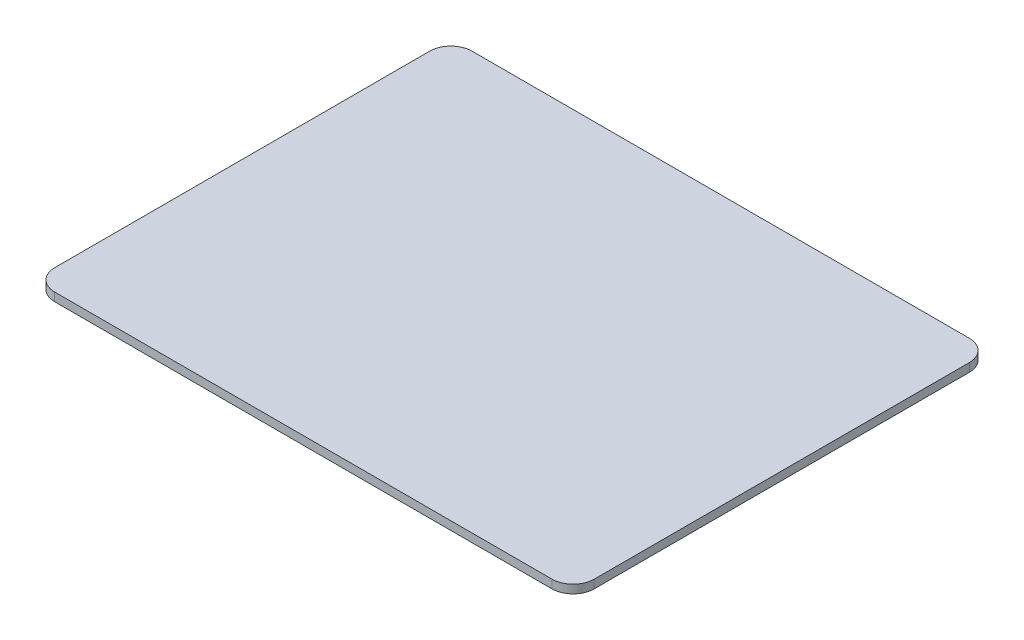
ISO-10303-21;
HEADER;
FILE_DESCRIPTION(('STEP AP214'),'2;1');
FILE_NAME('part.step','',(''),(''),'','','');
FILE_SCHEMA(('AUTOMOTIVE_DESIGN { 1 0 10303 214 1 1 1 1 }'));
ENDSEC;
DATA;
#1=APPLICATION_CONTEXT('core data for automotive mechanical design processes');
#2=APPLICATION_PROTOCOL_DEFINITION('international standard','automotive_design',2000,#1);
#3=PRODUCT_CONTEXT('',#1,'mechanical');
#4=PRODUCT('Part','Part','',(#3));
#5=PRODUCT_RELATED_PRODUCT_CATEGORY('part','',(#4));
#6=PRODUCT_DEFINITION_FORMATION('','',#4);
#7=PRODUCT_DEFINITION_CONTEXT('part definition',#1,'design');
#8=PRODUCT_DEFINITION('design','',#6,#7);
#9=PRODUCT_DEFINITION_SHAPE('','',#8);
#10=(LENGTH_UNIT() NAMED_UNIT(*) SI_UNIT(.MILLI.,.METRE.));
#11=(NAMED_UNIT(*) PLANE_ANGLE_UNIT() SI_UNIT($,.RADIAN.));
#12=(NAMED_UNIT(*) SI_UNIT($,.STERADIAN.) SOLID_ANGLE_UNIT());
#13=UNCERTAINTY_MEASURE_WITH_UNIT(LENGTH_MEASURE(1.E-05),#10,'distance_accuracy_value','');
#14=(GEOMETRIC_REPRESENTATION_CONTEXT(3) GLOBAL_UNCERTAINTY_ASSIGNED_CONTEXT((#13)) GLOBAL_UNIT_ASSIGNED_CONTEXT((#10,
#11,#12)) REPRESENTATION_CONTEXT('',''));
#15=CARTESIAN_POINT('',(0.,0.,0.));
#16=DIRECTION('',(0.,0.,1.));
#17=DIRECTION('',(1.,0.,0.));
#18=AXIS2_PLACEMENT_3D('',#15,#16,#17);
#19=CARTESIAN_POINT('',(0.,1.,0.));
#20=DIRECTION('',(1.,0.,0.));
#21=DIRECTION('',(0.,0.,-1.));
#22=AXIS2_PLACEMENT_3D('',#19,#20,#21);
#23=PLANE('',#22);
#24=DIRECTION('',(0.,0.,1.));
#25=VECTOR('',#24,1.);
#26=CARTESIAN_POINT('',(0.,1.,0.));
#27=LINE('',#26,#25);
#28=CARTESIAN_POINT('',(0.,1.,-47.));
#29=VERTEX_POINT('',#28);
#30=CARTESIAN_POINT('',(0.,1.,-2.5));
#31=VERTEX_POINT('',#30);
#32=EDGE_CURVE('E118',#29,#31,#27,.T.);
#33=ORIENTED_EDGE('',*,*,#32,.F.);
#34=DIRECTION('',(0.,-1.,0.));
#35=VECTOR('',#34,1.);
#36=CARTESIAN_POINT('',(0.,1.,-47.));
#37=LINE('',#36,#35);
#38=CARTESIAN_POINT('',(0.,0.,-47.));
#39=VERTEX_POINT('',#38);
#40=EDGE_CURVE('E103',#29,#39,#37,.T.);
#41=ORIENTED_EDGE('',*,*,#40,.T.);
#42=DIRECTION('',(0.,0.,1.));
#43=VECTOR('',#42,1.);
#44=CARTESIAN_POINT('',(0.,0.,0.));
#45=LINE('',#44,#43);
#46=CARTESIAN_POINT('',(0.,0.,-2.5));
#47=VERTEX_POINT('',#46);
#48=EDGE_CURVE('E115',#39,#47,#45,.T.);
#49=ORIENTED_EDGE('',*,*,#48,.T.);
#50=DIRECTION('',(0.,-1.,0.));
#51=VECTOR('',#50,1.);
#52=CARTESIAN_POINT('',(0.,1.,-2.5));
#53=LINE('',#52,#51);
#54=EDGE_CURVE('E120',#47,#31,#53,.F.);
#55=ORIENTED_EDGE('',*,*,#54,.T.);
#56=EDGE_LOOP('',(#33,#41,#49,#55));
#57=FACE_BOUND('',#56,.T.);
#58=ADVANCED_FACE('F33',(#57),#23,.F.);
#59=CARTESIAN_POINT('',(0.,1.,0.));
#60=DIRECTION('',(0.,0.,-1.));
#61=DIRECTION('',(-1.,0.,0.));
#62=AXIS2_PLACEMENT_3D('',#59,#60,#61);
#63=PLANE('',#62);
#64=DIRECTION('',(1.,0.,0.));
#65=VECTOR('',#64,1.);
#66=CARTESIAN_POINT('',(0.,0.,0.));
#67=LINE('',#66,#65);
#68=CARTESIAN_POINT('',(2.5,0.,0.));
#69=VERTEX_POINT('',#68);
#70=CARTESIAN_POINT('',(61.5,0.,0.));
#71=VERTEX_POINT('',#70);
#72=EDGE_CURVE('E124',#69,#71,#67,.T.);
#73=ORIENTED_EDGE('',*,*,#72,.T.);
#74=DIRECTION('',(0.,-1.,0.));
#75=VECTOR('',#74,1.);
#76=CARTESIAN_POINT('',(61.5,1.,0.));
#77=LINE('',#76,#75);
#78=CARTESIAN_POINT('',(61.5,1.,0.));
#79=VERTEX_POINT('',#78);
#80=EDGE_CURVE('E11',#71,#79,#77,.F.);
#81=ORIENTED_EDGE('',*,*,#80,.T.);
#82=DIRECTION('',(1.,0.,0.));
#83=VECTOR('',#82,1.);
#84=CARTESIAN_POINT('',(0.,1.,0.));
#85=LINE('',#84,#83);
#86=CARTESIAN_POINT('',(2.5,1.,0.));
#87=VERTEX_POINT('',#86);
#88=EDGE_CURVE('E160',#87,#79,#85,.T.);
#89=ORIENTED_EDGE('',*,*,#88,.F.);
#90=DIRECTION('',(0.,-1.,0.));
#91=VECTOR('',#90,1.);
#92=CARTESIAN_POINT('',(2.5,1.,0.));
#93=LINE('',#92,#91);
#94=EDGE_CURVE('E41',#87,#69,#93,.T.);
#95=ORIENTED_EDGE('',*,*,#94,.T.);
#96=EDGE_LOOP('',(#73,#81,#89,#95));
#97=FACE_BOUND('',#96,.T.);
#98=ADVANCED_FACE('F158',(#97),#63,.F.);
#99=CARTESIAN_POINT('',(64.,1.,0.));
#100=DIRECTION('',(-1.,0.,0.));
#101=DIRECTION('',(0.,0.,1.));
#102=AXIS2_PLACEMENT_3D('',#99,#100,#101);
#103=PLANE('',#102);
#104=DIRECTION('',(0.,0.,-1.));
#105=VECTOR('',#104,1.);
#106=CARTESIAN_POINT('',(64.,0.,0.));
#107=LINE('',#106,#105);
#108=CARTESIAN_POINT('',(64.,0.,-2.5));
#109=VERTEX_POINT('',#108);
#110=CARTESIAN_POINT('',(64.,0.,-47.));
#111=VERTEX_POINT('',#110);
#112=EDGE_CURVE('E127',#109,#111,#107,.T.);
#113=ORIENTED_EDGE('',*,*,#112,.T.);
#114=DIRECTION('',(0.,-1.,0.));
#115=VECTOR('',#114,1.);
#116=CARTESIAN_POINT('',(64.,1.,-47.));
#117=LINE('',#116,#115);
#118=CARTESIAN_POINT('',(64.,1.,-47.));
#119=VERTEX_POINT('',#118);
#120=EDGE_CURVE('E48',#111,#119,#117,.F.);
#121=ORIENTED_EDGE('',*,*,#120,.T.);
#122=DIRECTION('',(0.,0.,-1.));
#123=VECTOR('',#122,1.);
#124=CARTESIAN_POINT('',(64.,1.,0.));
#125=LINE('',#124,#123);
#126=CARTESIAN_POINT('',(64.,1.,-2.5));
#127=VERTEX_POINT('',#126);
#128=EDGE_CURVE('E168',#127,#119,#125,.T.);
#129=ORIENTED_EDGE('',*,*,#128,.F.);
#130=DIRECTION('',(0.,-1.,0.));
#131=VECTOR('',#130,1.);
#132=CARTESIAN_POINT('',(64.,1.,-2.5));
#133=LINE('',#132,#131);
#134=EDGE_CURVE('E151',#127,#109,#133,.T.);
#135=ORIENTED_EDGE('',*,*,#134,.T.);
#136=EDGE_LOOP('',(#113,#121,#129,#135));
#137=FACE_BOUND('',#136,.T.);
#138=ADVANCED_FACE('F167',(#137),#103,.F.);
#139=CARTESIAN_POINT('',(0.,1.,-49.5));
#140=DIRECTION('',(0.,0.,1.));
#141=DIRECTION('',(1.,0.,0.));
#142=AXIS2_PLACEMENT_3D('',#139,#140,#141);
#143=PLANE('',#142);
#144=DIRECTION('',(-1.,0.,0.));
#145=VECTOR('',#144,1.);
#146=CARTESIAN_POINT('',(0.,0.,-49.5));
#147=LINE('',#146,#145);
#148=CARTESIAN_POINT('',(61.5,0.,-49.5));
#149=VERTEX_POINT('',#148);
#150=CARTESIAN_POINT('',(2.5,0.,-49.5));
#151=VERTEX_POINT('',#150);
#152=EDGE_CURVE('E134',#149,#151,#147,.T.);
#153=ORIENTED_EDGE('',*,*,#152,.T.);
#154=DIRECTION('',(0.,-1.,0.));
#155=VECTOR('',#154,1.);
#156=CARTESIAN_POINT('',(2.5,1.,-49.5));
#157=LINE('',#156,#155);
#158=CARTESIAN_POINT('',(2.5,1.,-49.5));
#159=VERTEX_POINT('',#158);
#160=EDGE_CURVE('E104',#151,#159,#157,.F.);
#161=ORIENTED_EDGE('',*,*,#160,.T.);
#162=DIRECTION('',(-1.,0.,0.));
#163=VECTOR('',#162,1.);
#164=CARTESIAN_POINT('',(0.,1.,-49.5));
#165=LINE('',#164,#163);
#166=CARTESIAN_POINT('',(61.5,1.,-49.5));
#167=VERTEX_POINT('',#166);
#168=EDGE_CURVE('E130',#167,#159,#165,.T.);
#169=ORIENTED_EDGE('',*,*,#168,.F.);
#170=DIRECTION('',(0.,-1.,0.));
#171=VECTOR('',#170,1.);
#172=CARTESIAN_POINT('',(61.5,1.,-49.5));
#173=LINE('',#172,#171);
#174=EDGE_CURVE('E109',#167,#149,#173,.T.);
#175=ORIENTED_EDGE('',*,*,#174,.T.);
#176=EDGE_LOOP('',(#153,#161,#169,#175));
#177=FACE_BOUND('',#176,.T.);
#178=ADVANCED_FACE('F196',(#177),#143,.F.);
#179=CARTESIAN_POINT('',(0.,1.,0.));
#180=DIRECTION('',(0.,-1.,0.));
#181=DIRECTION('',(0.,0.,-1.));
#182=AXIS2_PLACEMENT_3D('',#179,#180,#181);
#183=PLANE('',#182);
#184=ORIENTED_EDGE('',*,*,#168,.T.);
#185=CARTESIAN_POINT('',(2.5,1.,-47.));
#186=DIRECTION('',(0.,-1.,0.));
#187=DIRECTION('',(0.,0.,-1.));
#188=AXIS2_PLACEMENT_3D('',#185,#186,#187);
#189=CIRCLE('',#188,2.5);
#190=EDGE_CURVE('E149',#159,#29,#189,.F.);
#191=ORIENTED_EDGE('',*,*,#190,.T.);
#192=ORIENTED_EDGE('',*,*,#32,.T.);
#193=CARTESIAN_POINT('',(2.5,1.,-2.5));
#194=DIRECTION('',(0.,-1.,0.));
#195=DIRECTION('',(0.,0.,-1.));
#196=AXIS2_PLACEMENT_3D('',#193,#194,#195);
#197=CIRCLE('',#196,2.5);
#198=EDGE_CURVE('E144',#31,#87,#197,.F.);
#199=ORIENTED_EDGE('',*,*,#198,.T.);
#200=ORIENTED_EDGE('',*,*,#88,.T.);
#201=CARTESIAN_POINT('',(61.5,1.,-2.5));
#202=DIRECTION('',(0.,-1.,0.));
#203=DIRECTION('',(0.,0.,-1.));
#204=AXIS2_PLACEMENT_3D('',#201,#202,#203);
#205=CIRCLE('',#204,2.5);
#206=EDGE_CURVE('E55',#79,#127,#205,.F.);
#207=ORIENTED_EDGE('',*,*,#206,.T.);
#208=ORIENTED_EDGE('',*,*,#128,.T.);
#209=CARTESIAN_POINT('',(61.5,1.,-47.));
#210=DIRECTION('',(0.,-1.,0.));
#211=DIRECTION('',(0.,0.,-1.));
#212=AXIS2_PLACEMENT_3D('',#209,#210,#211);
#213=CIRCLE('',#212,2.5);
#214=EDGE_CURVE('E147',#119,#167,#213,.F.);
#215=ORIENTED_EDGE('',*,*,#214,.T.);
#216=EDGE_LOOP('',(#184,#191,#192,#199,#200,#207,#208,#215));
#217=FACE_BOUND('',#216,.T.);
#218=ADVANCED_FACE('F173',(#217),#183,.F.);
#219=CARTESIAN_POINT('',(0.,0.,0.));
#220=DIRECTION('',(0.,-1.,0.));
#221=DIRECTION('',(0.,0.,-1.));
#222=AXIS2_PLACEMENT_3D('',#219,#220,#221);
#223=PLANE('',#222);
#224=ORIENTED_EDGE('',*,*,#48,.F.);
#225=CARTESIAN_POINT('',(2.5,0.,-47.));
#226=DIRECTION('',(0.,-1.,0.));
#227=DIRECTION('',(0.,0.,-1.));
#228=AXIS2_PLACEMENT_3D('',#225,#226,#227);
#229=CIRCLE('',#228,2.5);
#230=EDGE_CURVE('E99',#39,#151,#229,.T.);
#231=ORIENTED_EDGE('',*,*,#230,.T.);
#232=ORIENTED_EDGE('',*,*,#152,.F.);
#233=CARTESIAN_POINT('',(61.5,0.,-47.));
#234=DIRECTION('',(0.,-1.,0.));
#235=DIRECTION('',(0.,0.,-1.));
#236=AXIS2_PLACEMENT_3D('',#233,#234,#235);
#237=CIRCLE('',#236,2.5);
#238=EDGE_CURVE('E110',#149,#111,#237,.T.);
#239=ORIENTED_EDGE('',*,*,#238,.T.);
#240=ORIENTED_EDGE('',*,*,#112,.F.);
#241=CARTESIAN_POINT('',(61.5,0.,-2.5));
#242=DIRECTION('',(0.,-1.,0.));
#243=DIRECTION('',(0.,0.,-1.));
#244=AXIS2_PLACEMENT_3D('',#241,#242,#243);
#245=CIRCLE('',#244,2.5);
#246=EDGE_CURVE('E138',#109,#71,#245,.T.);
#247=ORIENTED_EDGE('',*,*,#246,.T.);
#248=ORIENTED_EDGE('',*,*,#72,.F.);
#249=CARTESIAN_POINT('',(2.5,0.,-2.5));
#250=DIRECTION('',(0.,-1.,0.));
#251=DIRECTION('',(0.,0.,-1.));
#252=AXIS2_PLACEMENT_3D('',#249,#250,#251);
#253=CIRCLE('',#252,2.5);
#254=EDGE_CURVE('E119',#69,#47,#253,.T.);
#255=ORIENTED_EDGE('',*,*,#254,.T.);
#256=EDGE_LOOP('',(#224,#231,#232,#239,#240,#247,#248,#255));
#257=FACE_BOUND('',#256,.T.);
#258=ADVANCED_FACE('F122',(#257),#223,.T.);
#259=CARTESIAN_POINT('',(2.5,1.,-47.));
#260=DIRECTION('',(0.,-1.,0.));
#261=DIRECTION('',(0.,0.,-1.));
#262=AXIS2_PLACEMENT_3D('',#259,#260,#261);
#263=CYLINDRICAL_SURFACE('',#262,2.5);
#264=ORIENTED_EDGE('',*,*,#190,.F.);
#265=ORIENTED_EDGE('',*,*,#160,.F.);
#266=ORIENTED_EDGE('',*,*,#230,.F.);
#267=ORIENTED_EDGE('',*,*,#40,.F.);
#268=EDGE_LOOP('',(#264,#265,#266,#267));
#269=FACE_BOUND('',#268,.T.);
#270=ADVANCED_FACE('F102',(#269),#263,.T.);
#271=CARTESIAN_POINT('',(61.5,1.,-47.));
#272=DIRECTION('',(0.,-1.,0.));
#273=DIRECTION('',(0.,0.,-1.));
#274=AXIS2_PLACEMENT_3D('',#271,#272,#273);
#275=CYLINDRICAL_SURFACE('',#274,2.5);
#276=ORIENTED_EDGE('',*,*,#214,.F.);
#277=ORIENTED_EDGE('',*,*,#120,.F.);
#278=ORIENTED_EDGE('',*,*,#238,.F.);
#279=ORIENTED_EDGE('',*,*,#174,.F.);
#280=EDGE_LOOP('',(#276,#277,#278,#279));
#281=FACE_BOUND('',#280,.T.);
#282=ADVANCED_FACE('F178',(#281),#275,.T.);
#283=CARTESIAN_POINT('',(61.5,1.,-2.5));
#284=DIRECTION('',(0.,-1.,0.));
#285=DIRECTION('',(0.,0.,-1.));
#286=AXIS2_PLACEMENT_3D('',#283,#284,#285);
#287=CYLINDRICAL_SURFACE('',#286,2.5);
#288=ORIENTED_EDGE('',*,*,#206,.F.);
#289=ORIENTED_EDGE('',*,*,#80,.F.);
#290=ORIENTED_EDGE('',*,*,#246,.F.);
#291=ORIENTED_EDGE('',*,*,#134,.F.);
#292=EDGE_LOOP('',(#288,#289,#290,#291));
#293=FACE_BOUND('',#292,.T.);
#294=ADVANCED_FACE('F166',(#293),#287,.T.);
#295=CARTESIAN_POINT('',(2.5,1.,-2.5));
#296=DIRECTION('',(0.,-1.,0.));
#297=DIRECTION('',(0.,0.,-1.));
#298=AXIS2_PLACEMENT_3D('',#295,#296,#297);
#299=CYLINDRICAL_SURFACE('',#298,2.5);
#300=ORIENTED_EDGE('',*,*,#198,.F.);
#301=ORIENTED_EDGE('',*,*,#54,.F.);
#302=ORIENTED_EDGE('',*,*,#254,.F.);
#303=ORIENTED_EDGE('',*,*,#94,.F.);
#304=EDGE_LOOP('',(#300,#301,#302,#303));
#305=FACE_BOUND('',#304,.T.);
#306=ADVANCED_FACE('F35',(#305),#299,.T.);
#307=CLOSED_SHELL('',(#58,#98,#138,#178,#218,#258,#270,#282,#294,#306));
#308=MANIFOLD_SOLID_BREP('B2',#307);
#309=ADVANCED_BREP_SHAPE_REPRESENTATION('',(#18,#308),#14);
#310=SHAPE_DEFINITION_REPRESENTATION(#9,#309);
ENDSEC;
END-ISO-10303-21;
